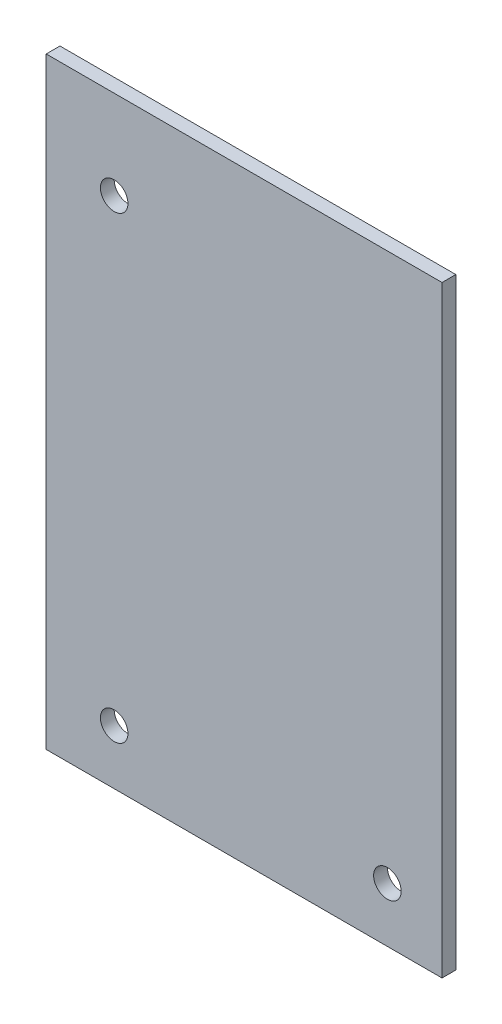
ISO-10303-21;
HEADER;
FILE_DESCRIPTION(('STEP AP214'),'2;1');
FILE_NAME('part.step','',(''),(''),'','','');
FILE_SCHEMA(('AUTOMOTIVE_DESIGN { 1 0 10303 214 1 1 1 1 }'));
ENDSEC;
DATA;
#1=APPLICATION_CONTEXT('core data for automotive mechanical design processes');
#2=APPLICATION_PROTOCOL_DEFINITION('international standard','automotive_design',2000,#1);
#3=PRODUCT_CONTEXT('',#1,'mechanical');
#4=PRODUCT('Part','Part','',(#3));
#5=PRODUCT_RELATED_PRODUCT_CATEGORY('part','',(#4));
#6=PRODUCT_DEFINITION_FORMATION('','',#4);
#7=PRODUCT_DEFINITION_CONTEXT('part definition',#1,'design');
#8=PRODUCT_DEFINITION('design','',#6,#7);
#9=PRODUCT_DEFINITION_SHAPE('','',#8);
#10=(LENGTH_UNIT() NAMED_UNIT(*) SI_UNIT(.MILLI.,.METRE.));
#11=(NAMED_UNIT(*) PLANE_ANGLE_UNIT() SI_UNIT($,.RADIAN.));
#12=(NAMED_UNIT(*) SI_UNIT($,.STERADIAN.) SOLID_ANGLE_UNIT());
#13=UNCERTAINTY_MEASURE_WITH_UNIT(LENGTH_MEASURE(1.E-05),#10,'distance_accuracy_value','');
#14=(GEOMETRIC_REPRESENTATION_CONTEXT(3) GLOBAL_UNCERTAINTY_ASSIGNED_CONTEXT((#13)) GLOBAL_UNIT_ASSIGNED_CONTEXT((#10,
#11,#12)) REPRESENTATION_CONTEXT('',''));
#15=CARTESIAN_POINT('',(0.,0.,0.));
#16=DIRECTION('',(0.,0.,1.));
#17=DIRECTION('',(1.,0.,0.));
#18=AXIS2_PLACEMENT_3D('',#15,#16,#17);
#19=CARTESIAN_POINT('',(0.,0.,1.6));
#20=DIRECTION('',(0.,0.,1.));
#21=DIRECTION('',(1.,0.,0.));
#22=AXIS2_PLACEMENT_3D('',#19,#20,#21);
#23=PLANE('',#22);
#24=CARTESIAN_POINT('',(16.65,-28.65,1.6));
#25=DIRECTION('',(0.,0.,1.));
#26=DIRECTION('',(1.,0.,0.));
#27=AXIS2_PLACEMENT_3D('',#24,#25,#26);
#28=CIRCLE('',#27,1.6);
#29=CARTESIAN_POINT('',(18.25,-28.65,1.6));
#30=VERTEX_POINT('',#29);
#31=EDGE_CURVE('E88',#30,#30,#28,.F.);
#32=ORIENTED_EDGE('',*,*,#31,.T.);
#33=EDGE_LOOP('',(#32));
#34=FACE_BOUND('',#33,.T.);
#35=CARTESIAN_POINT('',(-15.1,24.69,1.6));
#36=DIRECTION('',(0.,0.,1.));
#37=DIRECTION('',(1.,0.,0.));
#38=AXIS2_PLACEMENT_3D('',#35,#36,#37);
#39=CIRCLE('',#38,1.6);
#40=CARTESIAN_POINT('',(-13.5,24.69,1.6));
#41=VERTEX_POINT('',#40);
#42=EDGE_CURVE('E90',#41,#41,#39,.F.);
#43=ORIENTED_EDGE('',*,*,#42,.T.);
#44=EDGE_LOOP('',(#43));
#45=FACE_BOUND('',#44,.T.);
#46=CARTESIAN_POINT('',(-15.1,-28.65,1.6));
#47=DIRECTION('',(0.,0.,1.));
#48=DIRECTION('',(1.,0.,0.));
#49=AXIS2_PLACEMENT_3D('',#46,#47,#48);
#50=CIRCLE('',#49,1.6);
#51=CARTESIAN_POINT('',(-13.5,-28.65,1.6));
#52=VERTEX_POINT('',#51);
#53=EDGE_CURVE('E19',#52,#52,#50,.F.);
#54=ORIENTED_EDGE('',*,*,#53,.T.);
#55=EDGE_LOOP('',(#54));
#56=FACE_BOUND('',#55,.T.);
#57=DIRECTION('',(0.,1.,0.));
#58=VECTOR('',#57,1.);
#59=CARTESIAN_POINT('',(-23.,35.,1.6));
#60=LINE('',#59,#58);
#61=CARTESIAN_POINT('',(-23.,-35.,1.6));
#62=VERTEX_POINT('',#61);
#63=CARTESIAN_POINT('',(-23.,35.,1.6));
#64=VERTEX_POINT('',#63);
#65=EDGE_CURVE('E70',#62,#64,#60,.T.);
#66=ORIENTED_EDGE('',*,*,#65,.F.);
#67=DIRECTION('',(1.,0.,0.));
#68=VECTOR('',#67,1.);
#69=CARTESIAN_POINT('',(-23.,-35.,1.6));
#70=LINE('',#69,#68);
#71=CARTESIAN_POINT('',(23.,-35.,1.6));
#72=VERTEX_POINT('',#71);
#73=EDGE_CURVE('E67',#72,#62,#70,.F.);
#74=ORIENTED_EDGE('',*,*,#73,.F.);
#75=DIRECTION('',(0.,1.,0.));
#76=VECTOR('',#75,1.);
#77=CARTESIAN_POINT('',(23.,-35.,1.6));
#78=LINE('',#77,#76);
#79=CARTESIAN_POINT('',(23.,35.,1.6));
#80=VERTEX_POINT('',#79);
#81=EDGE_CURVE('E58',#80,#72,#78,.F.);
#82=ORIENTED_EDGE('',*,*,#81,.F.);
#83=DIRECTION('',(1.,0.,0.));
#84=VECTOR('',#83,1.);
#85=CARTESIAN_POINT('',(23.,35.,1.6));
#86=LINE('',#85,#84);
#87=EDGE_CURVE('E53',#64,#80,#86,.T.);
#88=ORIENTED_EDGE('',*,*,#87,.F.);
#89=EDGE_LOOP('',(#66,#74,#82,#88));
#90=FACE_BOUND('',#89,.T.);
#91=ADVANCED_FACE('F16',(#34,#45,#56,#90),#23,.T.);
#92=CARTESIAN_POINT('',(-23.,-35.,0.));
#93=DIRECTION('',(0.,-1.,0.));
#94=DIRECTION('',(0.,0.,-1.));
#95=AXIS2_PLACEMENT_3D('',#92,#93,#94);
#96=PLANE('',#95);
#97=DIRECTION('',(0.,0.,1.));
#98=VECTOR('',#97,1.);
#99=CARTESIAN_POINT('',(-23.,-35.,0.));
#100=LINE('',#99,#98);
#101=CARTESIAN_POINT('',(-23.,-35.,0.));
#102=VERTEX_POINT('',#101);
#103=EDGE_CURVE('E98',#102,#62,#100,.T.);
#104=ORIENTED_EDGE('',*,*,#103,.F.);
#105=DIRECTION('',(1.,0.,0.));
#106=VECTOR('',#105,1.);
#107=CARTESIAN_POINT('',(0.,-35.,0.));
#108=LINE('',#107,#106);
#109=CARTESIAN_POINT('',(23.,-35.,0.));
#110=VERTEX_POINT('',#109);
#111=EDGE_CURVE('E77',#102,#110,#108,.T.);
#112=ORIENTED_EDGE('',*,*,#111,.T.);
#113=DIRECTION('',(0.,0.,-1.));
#114=VECTOR('',#113,1.);
#115=CARTESIAN_POINT('',(23.,-35.,0.));
#116=LINE('',#115,#114);
#117=EDGE_CURVE('E63',#72,#110,#116,.T.);
#118=ORIENTED_EDGE('',*,*,#117,.F.);
#119=ORIENTED_EDGE('',*,*,#73,.T.);
#120=EDGE_LOOP('',(#104,#112,#118,#119));
#121=FACE_BOUND('',#120,.T.);
#122=ADVANCED_FACE('F76',(#121),#96,.T.);
#123=CARTESIAN_POINT('',(23.,-35.,0.));
#124=DIRECTION('',(1.,0.,0.));
#125=DIRECTION('',(0.,0.,-1.));
#126=AXIS2_PLACEMENT_3D('',#123,#124,#125);
#127=PLANE('',#126);
#128=ORIENTED_EDGE('',*,*,#117,.T.);
#129=DIRECTION('',(0.,1.,0.));
#130=VECTOR('',#129,1.);
#131=CARTESIAN_POINT('',(23.,0.,0.));
#132=LINE('',#131,#130);
#133=CARTESIAN_POINT('',(23.,35.,0.));
#134=VERTEX_POINT('',#133);
#135=EDGE_CURVE('E109',#110,#134,#132,.T.);
#136=ORIENTED_EDGE('',*,*,#135,.T.);
#137=DIRECTION('',(0.,0.,1.));
#138=VECTOR('',#137,1.);
#139=CARTESIAN_POINT('',(23.,35.,0.));
#140=LINE('',#139,#138);
#141=EDGE_CURVE('E65',#80,#134,#140,.F.);
#142=ORIENTED_EDGE('',*,*,#141,.F.);
#143=ORIENTED_EDGE('',*,*,#81,.T.);
#144=EDGE_LOOP('',(#128,#136,#142,#143));
#145=FACE_BOUND('',#144,.T.);
#146=ADVANCED_FACE('F60',(#145),#127,.T.);
#147=CARTESIAN_POINT('',(23.,35.,0.));
#148=DIRECTION('',(0.,1.,0.));
#149=DIRECTION('',(0.,0.,1.));
#150=AXIS2_PLACEMENT_3D('',#147,#148,#149);
#151=PLANE('',#150);
#152=ORIENTED_EDGE('',*,*,#141,.T.);
#153=DIRECTION('',(1.,0.,0.));
#154=VECTOR('',#153,1.);
#155=CARTESIAN_POINT('',(0.,35.,0.));
#156=LINE('',#155,#154);
#157=CARTESIAN_POINT('',(-23.,35.,0.));
#158=VERTEX_POINT('',#157);
#159=EDGE_CURVE('E106',#134,#158,#156,.F.);
#160=ORIENTED_EDGE('',*,*,#159,.T.);
#161=DIRECTION('',(0.,0.,1.));
#162=VECTOR('',#161,1.);
#163=CARTESIAN_POINT('',(-23.,35.,0.));
#164=LINE('',#163,#162);
#165=EDGE_CURVE('E34',#64,#158,#164,.F.);
#166=ORIENTED_EDGE('',*,*,#165,.F.);
#167=ORIENTED_EDGE('',*,*,#87,.T.);
#168=EDGE_LOOP('',(#152,#160,#166,#167));
#169=FACE_BOUND('',#168,.T.);
#170=ADVANCED_FACE('F105',(#169),#151,.T.);
#171=CARTESIAN_POINT('',(-23.,35.,0.));
#172=DIRECTION('',(-1.,0.,0.));
#173=DIRECTION('',(0.,0.,1.));
#174=AXIS2_PLACEMENT_3D('',#171,#172,#173);
#175=PLANE('',#174);
#176=ORIENTED_EDGE('',*,*,#165,.T.);
#177=DIRECTION('',(0.,1.,0.));
#178=VECTOR('',#177,1.);
#179=CARTESIAN_POINT('',(-23.,0.,0.));
#180=LINE('',#179,#178);
#181=EDGE_CURVE('E87',#158,#102,#180,.F.);
#182=ORIENTED_EDGE('',*,*,#181,.T.);
#183=ORIENTED_EDGE('',*,*,#103,.T.);
#184=ORIENTED_EDGE('',*,*,#65,.T.);
#185=EDGE_LOOP('',(#176,#182,#183,#184));
#186=FACE_BOUND('',#185,.T.);
#187=ADVANCED_FACE('F112',(#186),#175,.T.);
#188=CARTESIAN_POINT('',(-15.1,-28.65,0.));
#189=DIRECTION('',(0.,0.,1.));
#190=DIRECTION('',(1.,0.,0.));
#191=AXIS2_PLACEMENT_3D('',#188,#189,#190);
#192=CYLINDRICAL_SURFACE('',#191,1.6);
#193=ORIENTED_EDGE('',*,*,#53,.F.);
#194=EDGE_LOOP('',(#193));
#195=FACE_BOUND('',#194,.T.);
#196=CARTESIAN_POINT('',(-15.1,-28.65,0.));
#197=DIRECTION('',(0.,0.,1.));
#198=DIRECTION('',(1.,0.,0.));
#199=AXIS2_PLACEMENT_3D('',#196,#197,#198);
#200=CIRCLE('',#199,1.6);
#201=CARTESIAN_POINT('',(-13.5,-28.65,0.));
#202=VERTEX_POINT('',#201);
#203=EDGE_CURVE('E84',#202,#202,#200,.F.);
#204=ORIENTED_EDGE('',*,*,#203,.T.);
#205=EDGE_LOOP('',(#204));
#206=FACE_BOUND('',#205,.T.);
#207=ADVANCED_FACE('F114',(#195,#206),#192,.F.);
#208=CARTESIAN_POINT('',(-15.1,24.69,0.));
#209=DIRECTION('',(0.,0.,1.));
#210=DIRECTION('',(1.,0.,0.));
#211=AXIS2_PLACEMENT_3D('',#208,#209,#210);
#212=CYLINDRICAL_SURFACE('',#211,1.6);
#213=ORIENTED_EDGE('',*,*,#42,.F.);
#214=EDGE_LOOP('',(#213));
#215=FACE_BOUND('',#214,.T.);
#216=CARTESIAN_POINT('',(-15.1,24.69,0.));
#217=DIRECTION('',(0.,0.,1.));
#218=DIRECTION('',(1.,0.,0.));
#219=AXIS2_PLACEMENT_3D('',#216,#217,#218);
#220=CIRCLE('',#219,1.6);
#221=CARTESIAN_POINT('',(-13.5,24.69,0.));
#222=VERTEX_POINT('',#221);
#223=EDGE_CURVE('E25',#222,#222,#220,.F.);
#224=ORIENTED_EDGE('',*,*,#223,.T.);
#225=EDGE_LOOP('',(#224));
#226=FACE_BOUND('',#225,.T.);
#227=ADVANCED_FACE('F122',(#215,#226),#212,.F.);
#228=CARTESIAN_POINT('',(16.65,-28.65,0.));
#229=DIRECTION('',(0.,0.,1.));
#230=DIRECTION('',(1.,0.,0.));
#231=AXIS2_PLACEMENT_3D('',#228,#229,#230);
#232=CYLINDRICAL_SURFACE('',#231,1.6);
#233=ORIENTED_EDGE('',*,*,#31,.F.);
#234=EDGE_LOOP('',(#233));
#235=FACE_BOUND('',#234,.T.);
#236=CARTESIAN_POINT('',(16.65,-28.65,0.));
#237=DIRECTION('',(0.,0.,1.));
#238=DIRECTION('',(1.,0.,0.));
#239=AXIS2_PLACEMENT_3D('',#236,#237,#238);
#240=CIRCLE('',#239,1.6);
#241=CARTESIAN_POINT('',(18.25,-28.65,0.));
#242=VERTEX_POINT('',#241);
#243=EDGE_CURVE('E11',#242,#242,#240,.F.);
#244=ORIENTED_EDGE('',*,*,#243,.T.);
#245=EDGE_LOOP('',(#244));
#246=FACE_BOUND('',#245,.T.);
#247=ADVANCED_FACE('F127',(#235,#246),#232,.F.);
#248=CARTESIAN_POINT('',(0.,0.,0.));
#249=DIRECTION('',(0.,0.,1.));
#250=DIRECTION('',(1.,0.,0.));
#251=AXIS2_PLACEMENT_3D('',#248,#249,#250);
#252=PLANE('',#251);
#253=ORIENTED_EDGE('',*,*,#243,.F.);
#254=EDGE_LOOP('',(#253));
#255=FACE_BOUND('',#254,.T.);
#256=ORIENTED_EDGE('',*,*,#223,.F.);
#257=EDGE_LOOP('',(#256));
#258=FACE_BOUND('',#257,.T.);
#259=ORIENTED_EDGE('',*,*,#203,.F.);
#260=EDGE_LOOP('',(#259));
#261=FACE_BOUND('',#260,.T.);
#262=ORIENTED_EDGE('',*,*,#159,.F.);
#263=ORIENTED_EDGE('',*,*,#135,.F.);
#264=ORIENTED_EDGE('',*,*,#111,.F.);
#265=ORIENTED_EDGE('',*,*,#181,.F.);
#266=EDGE_LOOP('',(#262,#263,#264,#265));
#267=FACE_BOUND('',#266,.T.);
#268=ADVANCED_FACE('F108',(#255,#258,#261,#267),#252,.F.);
#269=CLOSED_SHELL('',(#91,#122,#146,#170,#187,#207,#227,#247,#268));
#270=MANIFOLD_SOLID_BREP('B1',#269);
#271=ADVANCED_BREP_SHAPE_REPRESENTATION('',(#18,#270),#14);
#272=SHAPE_DEFINITION_REPRESENTATION(#9,#271);
ENDSEC;
END-ISO-10303-21;
